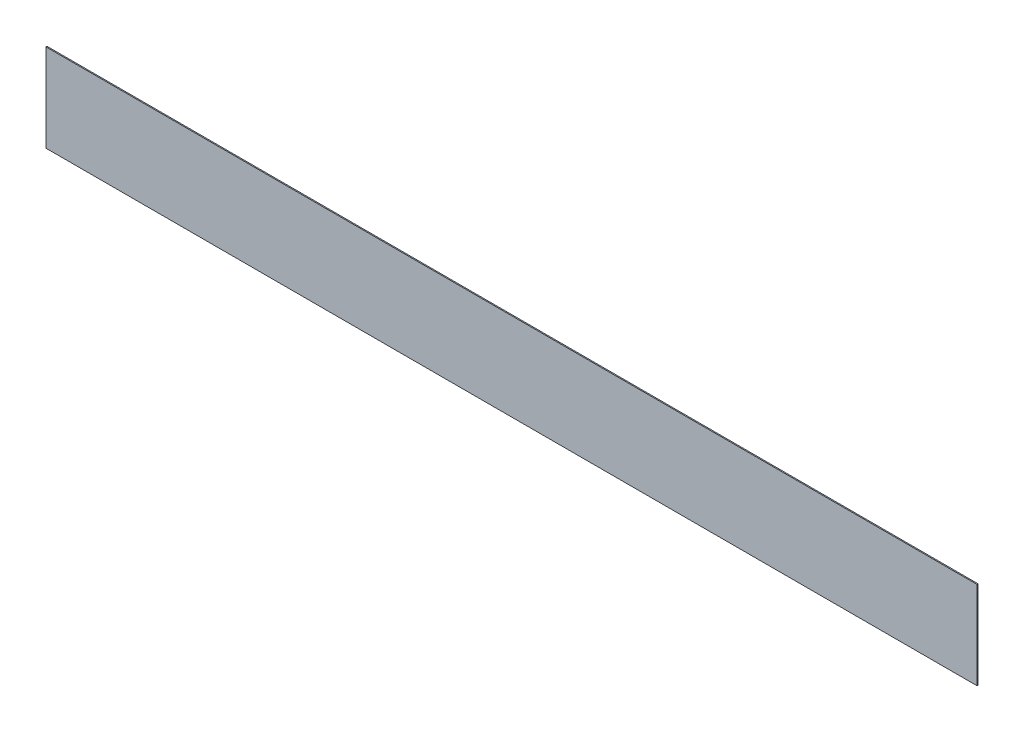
from build123d import *

# Parameters (mm, degrees)
ESQUISSE1_W        = 1750
ESQUISSE1_H        = 165
BOSS_EXTRU_1_DEPTH = 2


with BuildPart() as part:
    # Esquisse1 → Boss.-Extru.1 (new body)
    with BuildSketch(Plane.XY):
        with Locations((756.868931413, -43.647563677)):
            Rectangle(ESQUISSE1_W, ESQUISSE1_H)
    extrude(amount=BOSS_EXTRU_1_DEPTH)


solid = part.part
